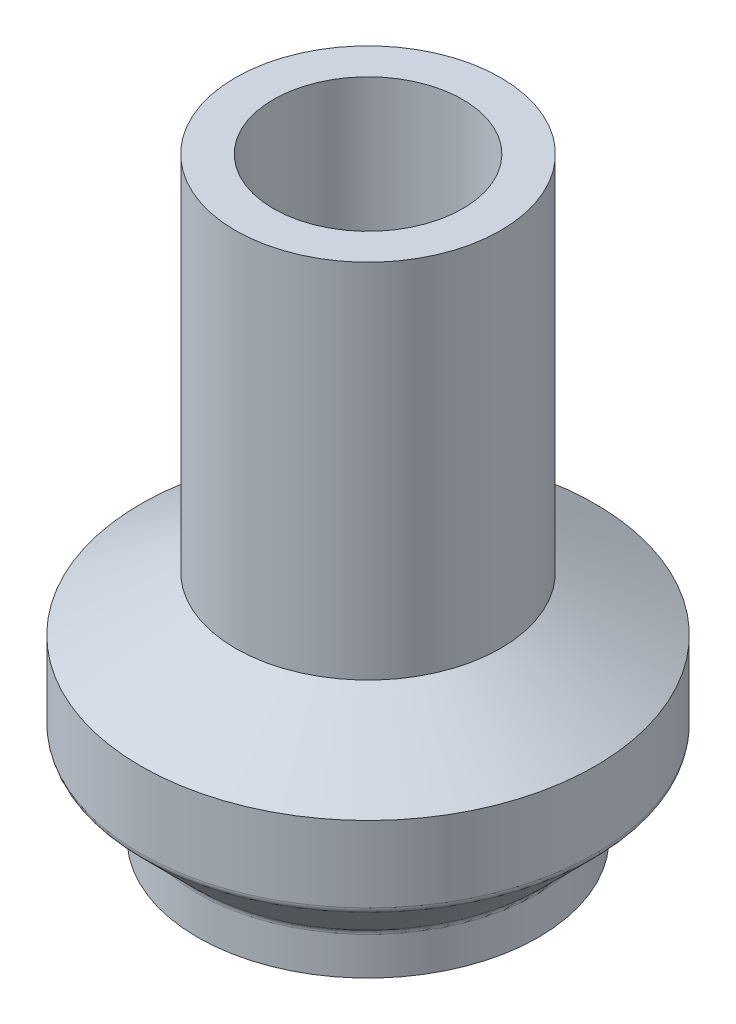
ISO-10303-21;
HEADER;
FILE_DESCRIPTION(('STEP AP214'),'2;1');
FILE_NAME('part.step','',(''),(''),'','','');
FILE_SCHEMA(('AUTOMOTIVE_DESIGN { 1 0 10303 214 1 1 1 1 }'));
ENDSEC;
DATA;
#1=APPLICATION_CONTEXT('core data for automotive mechanical design processes');
#2=APPLICATION_PROTOCOL_DEFINITION('international standard','automotive_design',2000,#1);
#3=PRODUCT_CONTEXT('',#1,'mechanical');
#4=PRODUCT('Part','Part','',(#3));
#5=PRODUCT_RELATED_PRODUCT_CATEGORY('part','',(#4));
#6=PRODUCT_DEFINITION_FORMATION('','',#4);
#7=PRODUCT_DEFINITION_CONTEXT('part definition',#1,'design');
#8=PRODUCT_DEFINITION('design','',#6,#7);
#9=PRODUCT_DEFINITION_SHAPE('','',#8);
#10=(LENGTH_UNIT() NAMED_UNIT(*) SI_UNIT(.MILLI.,.METRE.));
#11=(NAMED_UNIT(*) PLANE_ANGLE_UNIT() SI_UNIT($,.RADIAN.));
#12=(NAMED_UNIT(*) SI_UNIT($,.STERADIAN.) SOLID_ANGLE_UNIT());
#13=UNCERTAINTY_MEASURE_WITH_UNIT(LENGTH_MEASURE(1.E-05),#10,'distance_accuracy_value','');
#14=(GEOMETRIC_REPRESENTATION_CONTEXT(3) GLOBAL_UNCERTAINTY_ASSIGNED_CONTEXT((#13)) GLOBAL_UNIT_ASSIGNED_CONTEXT((#10,
#11,#12)) REPRESENTATION_CONTEXT('',''));
#15=CARTESIAN_POINT('',(0.,0.,0.));
#16=DIRECTION('',(0.,0.,1.));
#17=DIRECTION('',(1.,0.,0.));
#18=AXIS2_PLACEMENT_3D('',#15,#16,#17);
#19=CARTESIAN_POINT('',(3.88902869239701,35.2342932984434,0.));
#20=DIRECTION('',(0.,1.,0.));
#21=DIRECTION('',(0.,0.,1.));
#22=AXIS2_PLACEMENT_3D('',#19,#20,#21);
#23=CYLINDRICAL_SURFACE('',#22,4.5);
#24=CARTESIAN_POINT('',(3.88902869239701,19.2853570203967,0.));
#25=DIRECTION('',(0.,1.,0.));
#26=DIRECTION('',(0.,0.,1.));
#27=AXIS2_PLACEMENT_3D('',#24,#25,#26);
#28=CIRCLE('',#27,4.5);
#29=CARTESIAN_POINT('',(3.88902869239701,19.2853570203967,4.5));
#30=VERTEX_POINT('',#29);
#31=EDGE_CURVE('E10',#30,#30,#28,.T.);
#32=ORIENTED_EDGE('',*,*,#31,.T.);
#33=EDGE_LOOP('',(#32));
#34=FACE_BOUND('',#33,.T.);
#35=CARTESIAN_POINT('',(3.88902869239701,20.2853570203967,0.));
#36=DIRECTION('',(0.,1.,0.));
#37=DIRECTION('',(0.,0.,1.));
#38=AXIS2_PLACEMENT_3D('',#35,#36,#37);
#39=CIRCLE('',#38,4.5);
#40=CARTESIAN_POINT('',(3.88902869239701,20.2853570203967,4.5));
#41=VERTEX_POINT('',#40);
#42=EDGE_CURVE('E77',#41,#41,#39,.T.);
#43=ORIENTED_EDGE('',*,*,#42,.F.);
#44=EDGE_LOOP('',(#43));
#45=FACE_BOUND('',#44,.T.);
#46=ADVANCED_FACE('F31',(#34,#45),#23,.T.);
#47=CARTESIAN_POINT('',(-0.610971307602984,19.2853570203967,0.));
#48=DIRECTION('',(0.,-1.,0.));
#49=DIRECTION('',(0.,0.,-1.));
#50=AXIS2_PLACEMENT_3D('',#47,#48,#49);
#51=PLANE('',#50);
#52=CARTESIAN_POINT('',(3.88902869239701,19.2853570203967,0.));
#53=DIRECTION('',(0.,1.,0.));
#54=DIRECTION('',(0.,0.,1.));
#55=AXIS2_PLACEMENT_3D('',#52,#53,#54);
#56=CIRCLE('',#55,3.5);
#57=CARTESIAN_POINT('',(3.88902869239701,19.2853570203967,3.5));
#58=VERTEX_POINT('',#57);
#59=EDGE_CURVE('E37',#58,#58,#56,.T.);
#60=ORIENTED_EDGE('',*,*,#59,.T.);
#61=EDGE_LOOP('',(#60));
#62=FACE_BOUND('',#61,.T.);
#63=ORIENTED_EDGE('',*,*,#31,.F.);
#64=EDGE_LOOP('',(#63));
#65=FACE_BOUND('',#64,.T.);
#66=ADVANCED_FACE('F116',(#62,#65),#51,.T.);
#67=CARTESIAN_POINT('',(3.88902869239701,35.2342932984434,0.));
#68=DIRECTION('',(0.,1.,0.));
#69=DIRECTION('',(0.,0.,1.));
#70=AXIS2_PLACEMENT_3D('',#67,#68,#69);
#71=CYLINDRICAL_SURFACE('',#70,3.5);
#72=CARTESIAN_POINT('',(3.88902869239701,23.2853570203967,0.));
#73=DIRECTION('',(0.,1.,0.));
#74=DIRECTION('',(0.,0.,1.));
#75=AXIS2_PLACEMENT_3D('',#72,#73,#74);
#76=CIRCLE('',#75,3.5);
#77=CARTESIAN_POINT('',(3.88902869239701,23.2853570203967,3.5));
#78=VERTEX_POINT('',#77);
#79=EDGE_CURVE('E41',#78,#78,#76,.T.);
#80=ORIENTED_EDGE('',*,*,#79,.T.);
#81=EDGE_LOOP('',(#80));
#82=FACE_BOUND('',#81,.T.);
#83=ORIENTED_EDGE('',*,*,#59,.F.);
#84=EDGE_LOOP('',(#83));
#85=FACE_BOUND('',#84,.T.);
#86=ADVANCED_FACE('F120',(#82,#85),#71,.F.);
#87=CARTESIAN_POINT('',(0.389028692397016,23.2853570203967,0.));
#88=DIRECTION('',(0.,-1.,0.));
#89=DIRECTION('',(0.,0.,-1.));
#90=AXIS2_PLACEMENT_3D('',#87,#88,#89);
#91=PLANE('',#90);
#92=CARTESIAN_POINT('',(3.88902869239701,23.2853570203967,0.));
#93=DIRECTION('',(0.,1.,0.));
#94=DIRECTION('',(0.,0.,1.));
#95=AXIS2_PLACEMENT_3D('',#92,#93,#94);
#96=CIRCLE('',#95,3.);
#97=CARTESIAN_POINT('',(3.88902869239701,23.2853570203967,3.));
#98=VERTEX_POINT('',#97);
#99=EDGE_CURVE('E45',#98,#98,#96,.T.);
#100=ORIENTED_EDGE('',*,*,#99,.T.);
#101=EDGE_LOOP('',(#100));
#102=FACE_BOUND('',#101,.T.);
#103=ORIENTED_EDGE('',*,*,#79,.F.);
#104=EDGE_LOOP('',(#103));
#105=FACE_BOUND('',#104,.T.);
#106=ADVANCED_FACE('F183',(#102,#105),#91,.T.);
#107=CARTESIAN_POINT('',(3.88902869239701,35.2342932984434,0.));
#108=DIRECTION('',(0.,1.,0.));
#109=DIRECTION('',(0.,0.,1.));
#110=AXIS2_PLACEMENT_3D('',#107,#108,#109);
#111=CYLINDRICAL_SURFACE('',#110,3.);
#112=CARTESIAN_POINT('',(3.88902869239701,19.2853570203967,0.));
#113=DIRECTION('',(0.,1.,0.));
#114=DIRECTION('',(0.,0.,1.));
#115=AXIS2_PLACEMENT_3D('',#112,#113,#114);
#116=CIRCLE('',#115,3.);
#117=CARTESIAN_POINT('',(3.88902869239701,19.2853570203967,3.));
#118=VERTEX_POINT('',#117);
#119=EDGE_CURVE('E50',#118,#118,#116,.T.);
#120=ORIENTED_EDGE('',*,*,#119,.T.);
#121=EDGE_LOOP('',(#120));
#122=FACE_BOUND('',#121,.T.);
#123=ORIENTED_EDGE('',*,*,#99,.F.);
#124=EDGE_LOOP('',(#123));
#125=FACE_BOUND('',#124,.T.);
#126=ADVANCED_FACE('F175',(#122,#125),#111,.T.);
#127=CARTESIAN_POINT('',(0.889028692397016,19.2853570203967,0.));
#128=DIRECTION('',(0.,-1.,0.));
#129=DIRECTION('',(0.,0.,-1.));
#130=AXIS2_PLACEMENT_3D('',#127,#128,#129);
#131=PLANE('',#130);
#132=CARTESIAN_POINT('',(3.87661509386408,19.2853570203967,1.5));
#133=DIRECTION('',(0.,1.,0.));
#134=DIRECTION('',(0.,0.,1.));
#135=AXIS2_PLACEMENT_3D('',#132,#133,#134);
#136=CIRCLE('',#135,0.5);
#137=CARTESIAN_POINT('',(3.87661509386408,19.2853570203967,2.));
#138=VERTEX_POINT('',#137);
#139=EDGE_CURVE('E86',#138,#138,#136,.T.);
#140=ORIENTED_EDGE('',*,*,#139,.T.);
#141=EDGE_LOOP('',(#140));
#142=FACE_BOUND('',#141,.T.);
#143=CARTESIAN_POINT('',(3.87661509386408,19.2853570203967,-1.5));
#144=DIRECTION('',(0.,1.,0.));
#145=DIRECTION('',(0.,0.,1.));
#146=AXIS2_PLACEMENT_3D('',#143,#144,#145);
#147=CIRCLE('',#146,0.5);
#148=CARTESIAN_POINT('',(3.87661509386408,19.2853570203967,-1.));
#149=VERTEX_POINT('',#148);
#150=EDGE_CURVE('E80',#149,#149,#147,.T.);
#151=ORIENTED_EDGE('',*,*,#150,.T.);
#152=EDGE_LOOP('',(#151));
#153=FACE_BOUND('',#152,.T.);
#154=ORIENTED_EDGE('',*,*,#119,.F.);
#155=EDGE_LOOP('',(#154));
#156=FACE_BOUND('',#155,.T.);
#157=ADVANCED_FACE('F99',(#142,#153,#156),#131,.T.);
#158=CARTESIAN_POINT('',(1.38902869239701,29.9510424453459,0.));
#159=DIRECTION('',(0.,1.,0.));
#160=DIRECTION('',(0.,0.,1.));
#161=AXIS2_PLACEMENT_3D('',#158,#159,#160);
#162=PLANE('',#161);
#163=CARTESIAN_POINT('',(3.87661509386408,29.9510424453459,1.5));
#164=DIRECTION('',(0.,1.,0.));
#165=DIRECTION('',(0.,0.,1.));
#166=AXIS2_PLACEMENT_3D('',#163,#164,#165);
#167=CIRCLE('',#166,0.5);
#168=CARTESIAN_POINT('',(3.87661509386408,29.9510424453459,2.));
#169=VERTEX_POINT('',#168);
#170=EDGE_CURVE('E89',#169,#169,#167,.T.);
#171=ORIENTED_EDGE('',*,*,#170,.F.);
#172=EDGE_LOOP('',(#171));
#173=FACE_BOUND('',#172,.T.);
#174=CARTESIAN_POINT('',(3.87661509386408,29.9510424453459,-1.5));
#175=DIRECTION('',(0.,1.,0.));
#176=DIRECTION('',(0.,0.,1.));
#177=AXIS2_PLACEMENT_3D('',#174,#175,#176);
#178=CIRCLE('',#177,0.5);
#179=CARTESIAN_POINT('',(3.87661509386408,29.9510424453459,-1.));
#180=VERTEX_POINT('',#179);
#181=EDGE_CURVE('E83',#180,#180,#178,.T.);
#182=ORIENTED_EDGE('',*,*,#181,.F.);
#183=EDGE_LOOP('',(#182));
#184=FACE_BOUND('',#183,.T.);
#185=CARTESIAN_POINT('',(3.88902869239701,29.9510424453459,0.));
#186=DIRECTION('',(0.,1.,0.));
#187=DIRECTION('',(0.,0.,1.));
#188=AXIS2_PLACEMENT_3D('',#185,#186,#187);
#189=CIRCLE('',#188,2.5);
#190=CARTESIAN_POINT('',(3.88902869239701,29.9510424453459,2.5));
#191=VERTEX_POINT('',#190);
#192=EDGE_CURVE('E53',#191,#191,#189,.T.);
#193=ORIENTED_EDGE('',*,*,#192,.T.);
#194=EDGE_LOOP('',(#193));
#195=FACE_BOUND('',#194,.T.);
#196=ADVANCED_FACE('F95',(#173,#184,#195),#162,.T.);
#197=CARTESIAN_POINT('',(3.88902869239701,35.2342932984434,0.));
#198=DIRECTION('',(0.,1.,0.));
#199=DIRECTION('',(0.,0.,1.));
#200=AXIS2_PLACEMENT_3D('',#197,#198,#199);
#201=CYLINDRICAL_SURFACE('',#200,2.5);
#202=CARTESIAN_POINT('',(3.88902869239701,34.9510424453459,0.));
#203=DIRECTION('',(0.,1.,0.));
#204=DIRECTION('',(0.,0.,1.));
#205=AXIS2_PLACEMENT_3D('',#202,#203,#204);
#206=CIRCLE('',#205,2.5);
#207=CARTESIAN_POINT('',(3.88902869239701,34.9510424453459,2.5));
#208=VERTEX_POINT('',#207);
#209=EDGE_CURVE('E56',#208,#208,#206,.T.);
#210=ORIENTED_EDGE('',*,*,#209,.T.);
#211=EDGE_LOOP('',(#210));
#212=FACE_BOUND('',#211,.T.);
#213=ORIENTED_EDGE('',*,*,#192,.F.);
#214=EDGE_LOOP('',(#213));
#215=FACE_BOUND('',#214,.T.);
#216=ADVANCED_FACE('F98',(#212,#215),#201,.F.);
#217=CARTESIAN_POINT('',(0.389028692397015,34.9510424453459,0.));
#218=DIRECTION('',(0.,1.,0.));
#219=DIRECTION('',(0.,0.,1.));
#220=AXIS2_PLACEMENT_3D('',#217,#218,#219);
#221=PLANE('',#220);
#222=CARTESIAN_POINT('',(3.88902869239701,34.9510424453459,0.));
#223=DIRECTION('',(0.,1.,0.));
#224=DIRECTION('',(0.,0.,1.));
#225=AXIS2_PLACEMENT_3D('',#222,#223,#224);
#226=CIRCLE('',#225,3.5);
#227=CARTESIAN_POINT('',(3.88902869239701,34.9510424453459,3.5));
#228=VERTEX_POINT('',#227);
#229=EDGE_CURVE('E59',#228,#228,#226,.T.);
#230=ORIENTED_EDGE('',*,*,#229,.T.);
#231=EDGE_LOOP('',(#230));
#232=FACE_BOUND('',#231,.T.);
#233=ORIENTED_EDGE('',*,*,#209,.F.);
#234=EDGE_LOOP('',(#233));
#235=FACE_BOUND('',#234,.T.);
#236=ADVANCED_FACE('F106',(#232,#235),#221,.T.);
#237=CARTESIAN_POINT('',(3.88902869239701,35.2342932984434,0.));
#238=DIRECTION('',(0.,1.,0.));
#239=DIRECTION('',(0.,0.,1.));
#240=AXIS2_PLACEMENT_3D('',#237,#238,#239);
#241=CYLINDRICAL_SURFACE('',#240,3.5);
#242=CARTESIAN_POINT('',(3.88902869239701,25.39441811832,0.));
#243=DIRECTION('',(0.,1.,0.));
#244=DIRECTION('',(0.,0.,1.));
#245=AXIS2_PLACEMENT_3D('',#242,#243,#244);
#246=CIRCLE('',#245,3.5);
#247=CARTESIAN_POINT('',(3.88902869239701,25.39441811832,3.5));
#248=VERTEX_POINT('',#247);
#249=EDGE_CURVE('E62',#248,#248,#246,.T.);
#250=ORIENTED_EDGE('',*,*,#249,.T.);
#251=EDGE_LOOP('',(#250));
#252=FACE_BOUND('',#251,.T.);
#253=ORIENTED_EDGE('',*,*,#229,.F.);
#254=EDGE_LOOP('',(#253));
#255=FACE_BOUND('',#254,.T.);
#256=ADVANCED_FACE('F112',(#252,#255),#241,.T.);
#257=CARTESIAN_POINT('',(3.88902869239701,25.39441811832,0.));
#258=DIRECTION('',(0.,-1.,0.));
#259=DIRECTION('',(0.,0.,-1.));
#260=AXIS2_PLACEMENT_3D('',#257,#258,#259);
#261=CONICAL_SURFACE('',#260,3.5,1.0471975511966);
#262=CARTESIAN_POINT('',(3.88902869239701,23.9510424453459,0.));
#263=DIRECTION('',(0.,1.,0.));
#264=DIRECTION('',(0.,0.,1.));
#265=AXIS2_PLACEMENT_3D('',#262,#263,#264);
#266=CIRCLE('',#265,6.);
#267=CARTESIAN_POINT('',(3.88902869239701,23.9510424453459,6.));
#268=VERTEX_POINT('',#267);
#269=EDGE_CURVE('E65',#268,#268,#266,.T.);
#270=ORIENTED_EDGE('',*,*,#269,.T.);
#271=EDGE_LOOP('',(#270));
#272=FACE_BOUND('',#271,.T.);
#273=ORIENTED_EDGE('',*,*,#249,.F.);
#274=EDGE_LOOP('',(#273));
#275=FACE_BOUND('',#274,.T.);
#276=ADVANCED_FACE('F146',(#272,#275),#261,.T.);
#277=CARTESIAN_POINT('',(3.88902869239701,35.2342932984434,0.));
#278=DIRECTION('',(0.,1.,0.));
#279=DIRECTION('',(0.,0.,1.));
#280=AXIS2_PLACEMENT_3D('',#277,#278,#279);
#281=CYLINDRICAL_SURFACE('',#280,6.);
#282=CARTESIAN_POINT('',(3.88902869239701,21.9510424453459,0.));
#283=DIRECTION('',(0.,1.,0.));
#284=DIRECTION('',(0.,0.,1.));
#285=AXIS2_PLACEMENT_3D('',#282,#283,#284);
#286=CIRCLE('',#285,6.);
#287=CARTESIAN_POINT('',(3.88902869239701,21.9510424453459,6.));
#288=VERTEX_POINT('',#287);
#289=EDGE_CURVE('E68',#288,#288,#286,.T.);
#290=ORIENTED_EDGE('',*,*,#289,.T.);
#291=EDGE_LOOP('',(#290));
#292=FACE_BOUND('',#291,.T.);
#293=ORIENTED_EDGE('',*,*,#269,.F.);
#294=EDGE_LOOP('',(#293));
#295=FACE_BOUND('',#294,.T.);
#296=ADVANCED_FACE('F140',(#292,#295),#281,.T.);
#297=CARTESIAN_POINT('',(3.88902869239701,21.9510424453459,0.));
#298=DIRECTION('',(0.,1.,0.));
#299=DIRECTION('',(0.,0.,1.));
#300=AXIS2_PLACEMENT_3D('',#297,#298,#299);
#301=TOROIDAL_SURFACE('',#300,5.8,0.199999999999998);
#302=CARTESIAN_POINT('',(3.88902869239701,21.8096210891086,0.));
#303=DIRECTION('',(0.,1.,0.));
#304=DIRECTION('',(0.,0.,1.));
#305=AXIS2_PLACEMENT_3D('',#302,#303,#304);
#306=CIRCLE('',#305,5.94142135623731);
#307=CARTESIAN_POINT('',(3.88902869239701,21.8096210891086,5.94142135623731));
#308=VERTEX_POINT('',#307);
#309=EDGE_CURVE('E71',#308,#308,#306,.T.);
#310=ORIENTED_EDGE('',*,*,#309,.T.);
#311=EDGE_LOOP('',(#310));
#312=FACE_BOUND('',#311,.T.);
#313=ORIENTED_EDGE('',*,*,#289,.F.);
#314=EDGE_LOOP('',(#313));
#315=FACE_BOUND('',#314,.T.);
#316=ADVANCED_FACE('F134',(#312,#315),#301,.T.);
#317=CARTESIAN_POINT('',(3.88902869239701,21.8096210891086,0.));
#318=DIRECTION('',(0.,1.,0.));
#319=DIRECTION('',(0.,0.,1.));
#320=AXIS2_PLACEMENT_3D('',#317,#318,#319);
#321=CONICAL_SURFACE('',#320,5.94142135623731,0.785398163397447);
#322=CARTESIAN_POINT('',(3.88902869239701,20.426778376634,0.));
#323=DIRECTION('',(0.,1.,0.));
#324=DIRECTION('',(0.,0.,1.));
#325=AXIS2_PLACEMENT_3D('',#322,#323,#324);
#326=CIRCLE('',#325,4.55857864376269);
#327=CARTESIAN_POINT('',(3.88902869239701,20.426778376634,4.55857864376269));
#328=VERTEX_POINT('',#327);
#329=EDGE_CURVE('E74',#328,#328,#326,.T.);
#330=ORIENTED_EDGE('',*,*,#329,.T.);
#331=EDGE_LOOP('',(#330));
#332=FACE_BOUND('',#331,.T.);
#333=ORIENTED_EDGE('',*,*,#309,.F.);
#334=EDGE_LOOP('',(#333));
#335=FACE_BOUND('',#334,.T.);
#336=ADVANCED_FACE('F128',(#332,#335),#321,.T.);
#337=CARTESIAN_POINT('',(3.88902869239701,20.2853570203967,0.));
#338=DIRECTION('',(0.,1.,0.));
#339=DIRECTION('',(0.,0.,1.));
#340=AXIS2_PLACEMENT_3D('',#337,#338,#339);
#341=TOROIDAL_SURFACE('',#340,4.7,0.199999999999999);
#342=ORIENTED_EDGE('',*,*,#42,.T.);
#343=EDGE_LOOP('',(#342));
#344=FACE_BOUND('',#343,.T.);
#345=ORIENTED_EDGE('',*,*,#329,.F.);
#346=EDGE_LOOP('',(#345));
#347=FACE_BOUND('',#346,.T.);
#348=ADVANCED_FACE('F124',(#344,#347),#341,.F.);
#349=CARTESIAN_POINT('',(3.87661509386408,19.2853570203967,-1.5));
#350=DIRECTION('',(0.,1.,0.));
#351=DIRECTION('',(0.,0.,1.));
#352=AXIS2_PLACEMENT_3D('',#349,#350,#351);
#353=CYLINDRICAL_SURFACE('',#352,0.5);
#354=ORIENTED_EDGE('',*,*,#150,.F.);
#355=EDGE_LOOP('',(#354));
#356=FACE_BOUND('',#355,.T.);
#357=ORIENTED_EDGE('',*,*,#181,.T.);
#358=EDGE_LOOP('',(#357));
#359=FACE_BOUND('',#358,.T.);
#360=ADVANCED_FACE('F127',(#356,#359),#353,.F.);
#361=CARTESIAN_POINT('',(3.87661509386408,19.2853570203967,1.5));
#362=DIRECTION('',(0.,1.,0.));
#363=DIRECTION('',(0.,0.,1.));
#364=AXIS2_PLACEMENT_3D('',#361,#362,#363);
#365=CYLINDRICAL_SURFACE('',#364,0.5);
#366=ORIENTED_EDGE('',*,*,#139,.F.);
#367=EDGE_LOOP('',(#366));
#368=FACE_BOUND('',#367,.T.);
#369=ORIENTED_EDGE('',*,*,#170,.T.);
#370=EDGE_LOOP('',(#369));
#371=FACE_BOUND('',#370,.T.);
#372=ADVANCED_FACE('F93',(#368,#371),#365,.F.);
#373=CLOSED_SHELL('',(#46,#66,#86,#106,#126,#157,#196,#216,#236,#256,#276,#296,#316,#336,#348,
#360,#372));
#374=MANIFOLD_SOLID_BREP('B2',#373);
#375=ADVANCED_BREP_SHAPE_REPRESENTATION('',(#18,#374),#14);
#376=SHAPE_DEFINITION_REPRESENTATION(#9,#375);
ENDSEC;
END-ISO-10303-21;
